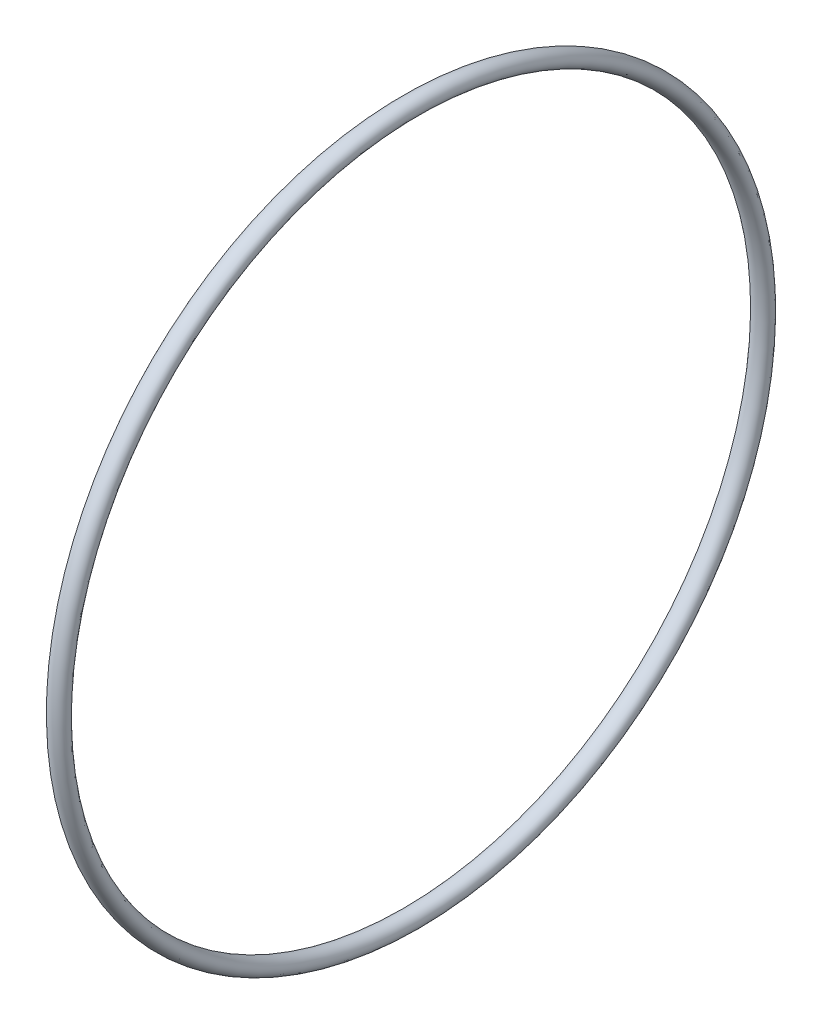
from build123d import *

# Parameters (mm, degrees)
ESQUISSE1_RX = 2.6
ESQUISSE1_RY = 2.05


with BuildPart() as part:
    # Esquisse1 → R_volution1 (revolve)
    with BuildSketch(Plane.XY):
        with Locations(Location((0, 92.9), (0, 0, 180))):
            Ellipse(ESQUISSE1_RX, ESQUISSE1_RY)
    revolve(axis=Axis((-22.476037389, 0, 0), (1, 0, 0)))


solid = part.part
